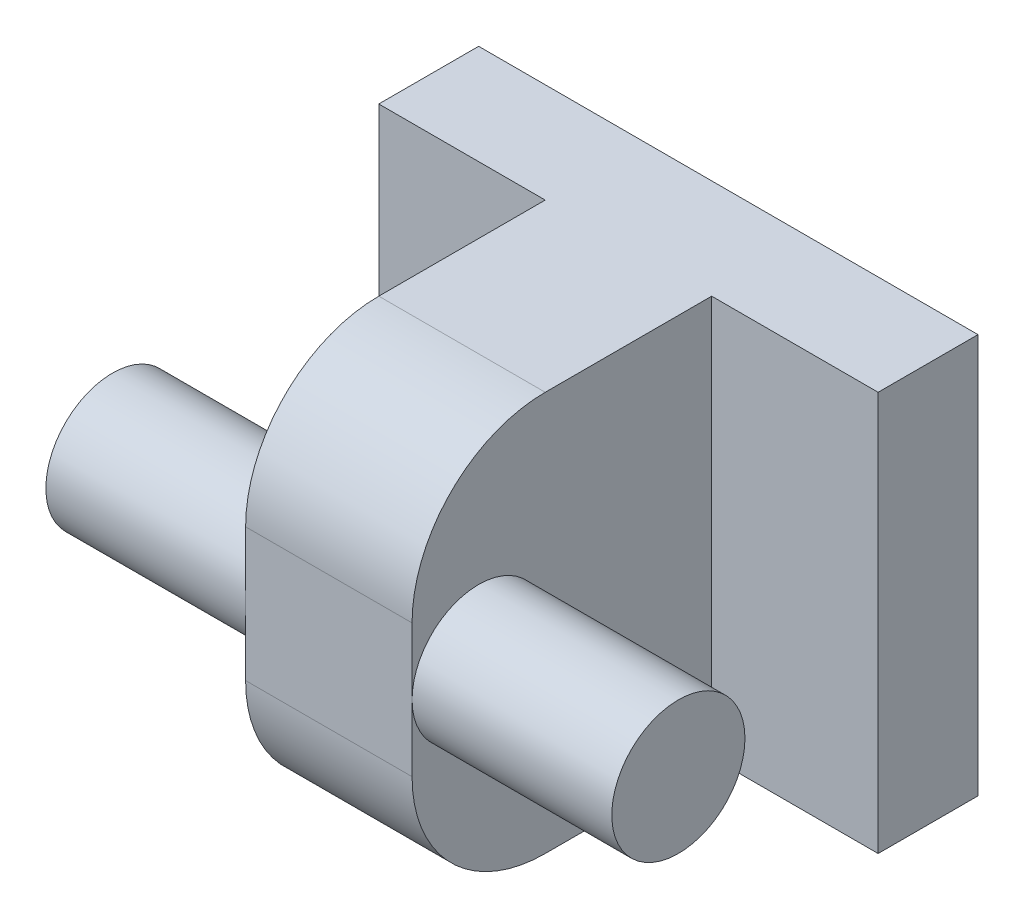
ISO-10303-21;
HEADER;
FILE_DESCRIPTION(('STEP AP214'),'2;1');
FILE_NAME('part.step','',(''),(''),'','','');
FILE_SCHEMA(('AUTOMOTIVE_DESIGN { 1 0 10303 214 1 1 1 1 }'));
ENDSEC;
DATA;
#1=APPLICATION_CONTEXT('core data for automotive mechanical design processes');
#2=APPLICATION_PROTOCOL_DEFINITION('international standard','automotive_design',2000,#1);
#3=PRODUCT_CONTEXT('',#1,'mechanical');
#4=PRODUCT('Part','Part','',(#3));
#5=PRODUCT_RELATED_PRODUCT_CATEGORY('part','',(#4));
#6=PRODUCT_DEFINITION_FORMATION('','',#4);
#7=PRODUCT_DEFINITION_CONTEXT('part definition',#1,'design');
#8=PRODUCT_DEFINITION('design','',#6,#7);
#9=PRODUCT_DEFINITION_SHAPE('','',#8);
#10=(LENGTH_UNIT() NAMED_UNIT(*) SI_UNIT(.MILLI.,.METRE.));
#11=(NAMED_UNIT(*) PLANE_ANGLE_UNIT() SI_UNIT($,.RADIAN.));
#12=(NAMED_UNIT(*) SI_UNIT($,.STERADIAN.) SOLID_ANGLE_UNIT());
#13=UNCERTAINTY_MEASURE_WITH_UNIT(LENGTH_MEASURE(1.E-05),#10,'distance_accuracy_value','');
#14=(GEOMETRIC_REPRESENTATION_CONTEXT(3) GLOBAL_UNCERTAINTY_ASSIGNED_CONTEXT((#13)) GLOBAL_UNIT_ASSIGNED_CONTEXT((#10,
#11,#12)) REPRESENTATION_CONTEXT('',''));
#15=CARTESIAN_POINT('',(0.,0.,0.));
#16=DIRECTION('',(0.,0.,1.));
#17=DIRECTION('',(1.,0.,0.));
#18=AXIS2_PLACEMENT_3D('',#15,#16,#17);
#19=CARTESIAN_POINT('',(0.,120.,30.));
#20=DIRECTION('',(0.,0.,-1.));
#21=DIRECTION('',(-1.,0.,0.));
#22=AXIS2_PLACEMENT_3D('',#19,#20,#21);
#23=PLANE('',#22);
#24=DIRECTION('',(0.,-1.,0.));
#25=VECTOR('',#24,1.);
#26=CARTESIAN_POINT('',(50.,0.,30.));
#27=LINE('',#26,#25);
#28=CARTESIAN_POINT('',(50.,120.,30.));
#29=VERTEX_POINT('',#28);
#30=CARTESIAN_POINT('',(50.,0.,30.));
#31=VERTEX_POINT('',#30);
#32=EDGE_CURVE('E137',#29,#31,#27,.T.);
#33=ORIENTED_EDGE('',*,*,#32,.F.);
#34=DIRECTION('',(-1.,0.,0.));
#35=VECTOR('',#34,1.);
#36=CARTESIAN_POINT('',(0.,120.,30.));
#37=LINE('',#36,#35);
#38=CARTESIAN_POINT('',(0.,120.,30.));
#39=VERTEX_POINT('',#38);
#40=EDGE_CURVE('E133',#29,#39,#37,.T.);
#41=ORIENTED_EDGE('',*,*,#40,.T.);
#42=DIRECTION('',(0.,-1.,0.));
#43=VECTOR('',#42,1.);
#44=CARTESIAN_POINT('',(0.,0.,30.));
#45=LINE('',#44,#43);
#46=CARTESIAN_POINT('',(0.,0.,30.));
#47=VERTEX_POINT('',#46);
#48=EDGE_CURVE('E156',#39,#47,#45,.T.);
#49=ORIENTED_EDGE('',*,*,#48,.T.);
#50=DIRECTION('',(1.,0.,0.));
#51=VECTOR('',#50,1.);
#52=CARTESIAN_POINT('',(0.,0.,30.));
#53=LINE('',#52,#51);
#54=EDGE_CURVE('E166',#47,#31,#53,.T.);
#55=ORIENTED_EDGE('',*,*,#54,.T.);
#56=EDGE_LOOP('',(#33,#41,#49,#55));
#57=FACE_BOUND('',#56,.T.);
#58=ADVANCED_FACE('F33',(#57),#23,.F.);
#59=DIRECTION('',(0.,1.,0.));
#60=VECTOR('',#59,1.);
#61=CARTESIAN_POINT('',(100.,0.,30.));
#62=LINE('',#61,#60);
#63=CARTESIAN_POINT('',(100.,0.,30.));
#64=VERTEX_POINT('',#63);
#65=CARTESIAN_POINT('',(100.,120.,30.));
#66=VERTEX_POINT('',#65);
#67=EDGE_CURVE('E127',#64,#66,#62,.T.);
#68=ORIENTED_EDGE('',*,*,#67,.F.);
#69=CARTESIAN_POINT('',(150.,0.,30.));
#70=VERTEX_POINT('',#69);
#71=EDGE_CURVE('E159',#64,#70,#53,.T.);
#72=ORIENTED_EDGE('',*,*,#71,.T.);
#73=DIRECTION('',(0.,1.,0.));
#74=VECTOR('',#73,1.);
#75=CARTESIAN_POINT('',(150.,0.,30.));
#76=LINE('',#75,#74);
#77=CARTESIAN_POINT('',(150.,120.,30.));
#78=VERTEX_POINT('',#77);
#79=EDGE_CURVE('E130',#70,#78,#76,.T.);
#80=ORIENTED_EDGE('',*,*,#79,.T.);
#81=EDGE_CURVE('E118',#78,#66,#37,.T.);
#82=ORIENTED_EDGE('',*,*,#81,.T.);
#83=EDGE_LOOP('',(#68,#72,#80,#82));
#84=FACE_BOUND('',#83,.T.);
#85=ADVANCED_FACE('F126',(#84),#23,.F.);
#86=CARTESIAN_POINT('',(0.,0.,30.));
#87=DIRECTION('',(1.,0.,0.));
#88=DIRECTION('',(0.,0.,-1.));
#89=AXIS2_PLACEMENT_3D('',#86,#87,#88);
#90=PLANE('',#89);
#91=DIRECTION('',(0.,-1.,0.));
#92=VECTOR('',#91,1.);
#93=CARTESIAN_POINT('',(0.,0.,0.));
#94=LINE('',#93,#92);
#95=CARTESIAN_POINT('',(0.,120.,0.));
#96=VERTEX_POINT('',#95);
#97=CARTESIAN_POINT('',(0.,0.,0.));
#98=VERTEX_POINT('',#97);
#99=EDGE_CURVE('E185',#96,#98,#94,.T.);
#100=ORIENTED_EDGE('',*,*,#99,.T.);
#101=DIRECTION('',(0.,0.,-1.));
#102=VECTOR('',#101,1.);
#103=CARTESIAN_POINT('',(0.,0.,30.));
#104=LINE('',#103,#102);
#105=EDGE_CURVE('E169',#47,#98,#104,.T.);
#106=ORIENTED_EDGE('',*,*,#105,.F.);
#107=ORIENTED_EDGE('',*,*,#48,.F.);
#108=DIRECTION('',(0.,0.,-1.));
#109=VECTOR('',#108,1.);
#110=CARTESIAN_POINT('',(0.,120.,30.));
#111=LINE('',#110,#109);
#112=EDGE_CURVE('E132',#39,#96,#111,.T.);
#113=ORIENTED_EDGE('',*,*,#112,.T.);
#114=EDGE_LOOP('',(#100,#106,#107,#113));
#115=FACE_BOUND('',#114,.T.);
#116=ADVANCED_FACE('F247',(#115),#90,.F.);
#117=CARTESIAN_POINT('',(0.,0.,30.));
#118=DIRECTION('',(0.,1.,0.));
#119=DIRECTION('',(0.,0.,1.));
#120=AXIS2_PLACEMENT_3D('',#117,#118,#119);
#121=PLANE('',#120);
#122=DIRECTION('',(0.,0.,-1.));
#123=VECTOR('',#122,1.);
#124=CARTESIAN_POINT('',(100.,0.,120.));
#125=LINE('',#124,#123);
#126=CARTESIAN_POINT('',(100.,0.,80.));
#127=VERTEX_POINT('',#126);
#128=EDGE_CURVE('E121',#127,#64,#125,.T.);
#129=ORIENTED_EDGE('',*,*,#128,.F.);
#130=DIRECTION('',(1.,0.,0.));
#131=VECTOR('',#130,1.);
#132=CARTESIAN_POINT('',(0.,0.,80.));
#133=LINE('',#132,#131);
#134=CARTESIAN_POINT('',(50.,0.,80.));
#135=VERTEX_POINT('',#134);
#136=EDGE_CURVE('E11',#127,#135,#133,.F.);
#137=ORIENTED_EDGE('',*,*,#136,.T.);
#138=DIRECTION('',(0.,0.,-1.));
#139=VECTOR('',#138,1.);
#140=CARTESIAN_POINT('',(50.,0.,120.));
#141=LINE('',#140,#139);
#142=EDGE_CURVE('E187',#135,#31,#141,.T.);
#143=ORIENTED_EDGE('',*,*,#142,.T.);
#144=ORIENTED_EDGE('',*,*,#54,.F.);
#145=ORIENTED_EDGE('',*,*,#105,.T.);
#146=DIRECTION('',(1.,0.,0.));
#147=VECTOR('',#146,1.);
#148=CARTESIAN_POINT('',(0.,0.,0.));
#149=LINE('',#148,#147);
#150=CARTESIAN_POINT('',(150.,0.,0.));
#151=VERTEX_POINT('',#150);
#152=EDGE_CURVE('E183',#98,#151,#149,.T.);
#153=ORIENTED_EDGE('',*,*,#152,.T.);
#154=DIRECTION('',(0.,0.,-1.));
#155=VECTOR('',#154,1.);
#156=CARTESIAN_POINT('',(150.,0.,30.));
#157=LINE('',#156,#155);
#158=EDGE_CURVE('E173',#70,#151,#157,.T.);
#159=ORIENTED_EDGE('',*,*,#158,.F.);
#160=ORIENTED_EDGE('',*,*,#71,.F.);
#161=EDGE_LOOP('',(#129,#137,#143,#144,#145,#153,#159,#160));
#162=FACE_BOUND('',#161,.T.);
#163=ADVANCED_FACE('F262',(#162),#121,.F.);
#164=CARTESIAN_POINT('',(150.,0.,30.));
#165=DIRECTION('',(-1.,0.,0.));
#166=DIRECTION('',(0.,0.,1.));
#167=AXIS2_PLACEMENT_3D('',#164,#165,#166);
#168=PLANE('',#167);
#169=DIRECTION('',(0.,1.,0.));
#170=VECTOR('',#169,1.);
#171=CARTESIAN_POINT('',(150.,0.,0.));
#172=LINE('',#171,#170);
#173=CARTESIAN_POINT('',(150.,120.,0.));
#174=VERTEX_POINT('',#173);
#175=EDGE_CURVE('E181',#151,#174,#172,.T.);
#176=ORIENTED_EDGE('',*,*,#175,.T.);
#177=DIRECTION('',(0.,0.,-1.));
#178=VECTOR('',#177,1.);
#179=CARTESIAN_POINT('',(150.,120.,30.));
#180=LINE('',#179,#178);
#181=EDGE_CURVE('E176',#78,#174,#180,.T.);
#182=ORIENTED_EDGE('',*,*,#181,.F.);
#183=ORIENTED_EDGE('',*,*,#79,.F.);
#184=ORIENTED_EDGE('',*,*,#158,.T.);
#185=EDGE_LOOP('',(#176,#182,#183,#184));
#186=FACE_BOUND('',#185,.T.);
#187=ADVANCED_FACE('F259',(#186),#168,.F.);
#188=CARTESIAN_POINT('',(0.,120.,30.));
#189=DIRECTION('',(0.,-1.,0.));
#190=DIRECTION('',(0.,0.,-1.));
#191=AXIS2_PLACEMENT_3D('',#188,#189,#190);
#192=PLANE('',#191);
#193=DIRECTION('',(0.,0.,-1.));
#194=VECTOR('',#193,1.);
#195=CARTESIAN_POINT('',(50.,120.,120.));
#196=LINE('',#195,#194);
#197=CARTESIAN_POINT('',(50.,120.,80.));
#198=VERTEX_POINT('',#197);
#199=EDGE_CURVE('E122',#198,#29,#196,.T.);
#200=ORIENTED_EDGE('',*,*,#199,.F.);
#201=DIRECTION('',(-1.,0.,0.));
#202=VECTOR('',#201,1.);
#203=CARTESIAN_POINT('',(0.,120.,80.));
#204=LINE('',#203,#202);
#205=CARTESIAN_POINT('',(100.,120.,80.));
#206=VERTEX_POINT('',#205);
#207=EDGE_CURVE('E56',#198,#206,#204,.F.);
#208=ORIENTED_EDGE('',*,*,#207,.T.);
#209=DIRECTION('',(0.,0.,-1.));
#210=VECTOR('',#209,1.);
#211=CARTESIAN_POINT('',(100.,120.,120.));
#212=LINE('',#211,#210);
#213=EDGE_CURVE('E114',#206,#66,#212,.T.);
#214=ORIENTED_EDGE('',*,*,#213,.T.);
#215=ORIENTED_EDGE('',*,*,#81,.F.);
#216=ORIENTED_EDGE('',*,*,#181,.T.);
#217=DIRECTION('',(-1.,0.,0.));
#218=VECTOR('',#217,1.);
#219=CARTESIAN_POINT('',(0.,120.,0.));
#220=LINE('',#219,#218);
#221=EDGE_CURVE('E160',#174,#96,#220,.T.);
#222=ORIENTED_EDGE('',*,*,#221,.T.);
#223=ORIENTED_EDGE('',*,*,#112,.F.);
#224=ORIENTED_EDGE('',*,*,#40,.F.);
#225=EDGE_LOOP('',(#200,#208,#214,#215,#216,#222,#223,#224));
#226=FACE_BOUND('',#225,.T.);
#227=ADVANCED_FACE('F116',(#226),#192,.F.);
#228=CARTESIAN_POINT('',(0.,120.,0.));
#229=DIRECTION('',(0.,0.,-1.));
#230=DIRECTION('',(-1.,0.,0.));
#231=AXIS2_PLACEMENT_3D('',#228,#229,#230);
#232=PLANE('',#231);
#233=CARTESIAN_POINT('',(75.,60.,0.));
#234=DIRECTION('',(0.,0.,-1.));
#235=DIRECTION('',(-1.,0.,0.));
#236=AXIS2_PLACEMENT_3D('',#233,#234,#235);
#237=CIRCLE('',#236,20.);
#238=CARTESIAN_POINT('',(55.,60.,0.));
#239=VERTEX_POINT('',#238);
#240=EDGE_CURVE('E367',#239,#239,#237,.T.);
#241=ORIENTED_EDGE('',*,*,#240,.F.);
#242=EDGE_LOOP('',(#241));
#243=FACE_BOUND('',#242,.T.);
#244=ORIENTED_EDGE('',*,*,#99,.F.);
#245=ORIENTED_EDGE('',*,*,#221,.F.);
#246=ORIENTED_EDGE('',*,*,#175,.F.);
#247=ORIENTED_EDGE('',*,*,#152,.F.);
#248=EDGE_LOOP('',(#244,#245,#246,#247));
#249=FACE_BOUND('',#248,.T.);
#250=ADVANCED_FACE('F253',(#243,#249),#232,.T.);
#251=CARTESIAN_POINT('',(50.,0.,120.));
#252=DIRECTION('',(1.,0.,0.));
#253=DIRECTION('',(0.,0.,-1.));
#254=AXIS2_PLACEMENT_3D('',#251,#252,#253);
#255=PLANE('',#254);
#256=DIRECTION('',(0.,-1.,0.));
#257=VECTOR('',#256,1.);
#258=CARTESIAN_POINT('',(50.,0.,120.));
#259=LINE('',#258,#257);
#260=CARTESIAN_POINT('',(50.,80.,120.));
#261=VERTEX_POINT('',#260);
#262=CARTESIAN_POINT('',(50.,60.,120.));
#263=VERTEX_POINT('',#262);
#264=EDGE_CURVE('E140',#261,#263,#259,.T.);
#265=ORIENTED_EDGE('',*,*,#264,.F.);
#266=CARTESIAN_POINT('',(50.,80.,80.));
#267=DIRECTION('',(1.,0.,0.));
#268=DIRECTION('',(0.,0.,-1.));
#269=AXIS2_PLACEMENT_3D('',#266,#267,#268);
#270=CIRCLE('',#269,40.);
#271=EDGE_CURVE('E215',#261,#198,#270,.F.);
#272=ORIENTED_EDGE('',*,*,#271,.T.);
#273=ORIENTED_EDGE('',*,*,#199,.T.);
#274=ORIENTED_EDGE('',*,*,#32,.T.);
#275=ORIENTED_EDGE('',*,*,#142,.F.);
#276=CARTESIAN_POINT('',(50.,40.,80.));
#277=DIRECTION('',(1.,0.,0.));
#278=DIRECTION('',(0.,0.,-1.));
#279=AXIS2_PLACEMENT_3D('',#276,#277,#278);
#280=CIRCLE('',#279,40.);
#281=CARTESIAN_POINT('',(50.,40.,120.));
#282=VERTEX_POINT('',#281);
#283=EDGE_CURVE('E202',#135,#282,#280,.F.);
#284=ORIENTED_EDGE('',*,*,#283,.T.);
#285=EDGE_CURVE('E136',#263,#282,#259,.T.);
#286=ORIENTED_EDGE('',*,*,#285,.F.);
#287=CARTESIAN_POINT('',(50.,60.,100.));
#288=DIRECTION('',(1.,0.,0.));
#289=DIRECTION('',(0.,0.,-1.));
#290=AXIS2_PLACEMENT_3D('',#287,#288,#289);
#291=CIRCLE('',#290,20.);
#292=EDGE_CURVE('E143',#263,#263,#291,.T.);
#293=ORIENTED_EDGE('',*,*,#292,.T.);
#294=EDGE_LOOP('',(#265,#272,#273,#274,#275,#284,#286,#293));
#295=FACE_BOUND('',#294,.T.);
#296=ADVANCED_FACE('F251',(#295),#255,.F.);
#297=CARTESIAN_POINT('',(100.,0.,120.));
#298=DIRECTION('',(-1.,0.,0.));
#299=DIRECTION('',(0.,0.,1.));
#300=AXIS2_PLACEMENT_3D('',#297,#298,#299);
#301=PLANE('',#300);
#302=ORIENTED_EDGE('',*,*,#213,.F.);
#303=CARTESIAN_POINT('',(100.,80.,80.));
#304=DIRECTION('',(-1.,0.,0.));
#305=DIRECTION('',(0.,0.,1.));
#306=AXIS2_PLACEMENT_3D('',#303,#304,#305);
#307=CIRCLE('',#306,40.);
#308=CARTESIAN_POINT('',(100.,80.,120.));
#309=VERTEX_POINT('',#308);
#310=EDGE_CURVE('E41',#206,#309,#307,.F.);
#311=ORIENTED_EDGE('',*,*,#310,.T.);
#312=DIRECTION('',(0.,1.,0.));
#313=VECTOR('',#312,1.);
#314=CARTESIAN_POINT('',(100.,0.,120.));
#315=LINE('',#314,#313);
#316=CARTESIAN_POINT('',(100.,60.,120.));
#317=VERTEX_POINT('',#316);
#318=EDGE_CURVE('E223',#317,#309,#315,.T.);
#319=ORIENTED_EDGE('',*,*,#318,.F.);
#320=CARTESIAN_POINT('',(100.,60.,100.));
#321=DIRECTION('',(-1.,0.,0.));
#322=DIRECTION('',(0.,0.,1.));
#323=AXIS2_PLACEMENT_3D('',#320,#321,#322);
#324=CIRCLE('',#323,20.);
#325=EDGE_CURVE('E377',#317,#317,#324,.T.);
#326=ORIENTED_EDGE('',*,*,#325,.T.);
#327=CARTESIAN_POINT('',(100.,40.,120.));
#328=VERTEX_POINT('',#327);
#329=EDGE_CURVE('E226',#328,#317,#315,.T.);
#330=ORIENTED_EDGE('',*,*,#329,.F.);
#331=CARTESIAN_POINT('',(100.,40.,80.));
#332=DIRECTION('',(-1.,0.,0.));
#333=DIRECTION('',(0.,0.,1.));
#334=AXIS2_PLACEMENT_3D('',#331,#332,#333);
#335=CIRCLE('',#334,40.);
#336=EDGE_CURVE('E48',#328,#127,#335,.F.);
#337=ORIENTED_EDGE('',*,*,#336,.T.);
#338=ORIENTED_EDGE('',*,*,#128,.T.);
#339=ORIENTED_EDGE('',*,*,#67,.T.);
#340=EDGE_LOOP('',(#302,#311,#319,#326,#330,#337,#338,#339));
#341=FACE_BOUND('',#340,.T.);
#342=ADVANCED_FACE('F135',(#341),#301,.F.);
#343=CARTESIAN_POINT('',(50.,120.,120.));
#344=DIRECTION('',(0.,0.,-1.));
#345=DIRECTION('',(-1.,0.,0.));
#346=AXIS2_PLACEMENT_3D('',#343,#344,#345);
#347=PLANE('',#346);
#348=ORIENTED_EDGE('',*,*,#318,.T.);
#349=DIRECTION('',(-1.,0.,0.));
#350=VECTOR('',#349,1.);
#351=CARTESIAN_POINT('',(50.,80.,120.));
#352=LINE('',#351,#350);
#353=EDGE_CURVE('E209',#309,#261,#352,.T.);
#354=ORIENTED_EDGE('',*,*,#353,.T.);
#355=ORIENTED_EDGE('',*,*,#264,.T.);
#356=ORIENTED_EDGE('',*,*,#285,.T.);
#357=DIRECTION('',(1.,0.,0.));
#358=VECTOR('',#357,1.);
#359=CARTESIAN_POINT('',(50.,40.,120.));
#360=LINE('',#359,#358);
#361=EDGE_CURVE('E172',#282,#328,#360,.T.);
#362=ORIENTED_EDGE('',*,*,#361,.T.);
#363=ORIENTED_EDGE('',*,*,#329,.T.);
#364=EDGE_LOOP('',(#348,#354,#355,#356,#362,#363));
#365=FACE_BOUND('',#364,.T.);
#366=ADVANCED_FACE('F225',(#365),#347,.F.);
#367=CARTESIAN_POINT('',(160.,60.,100.));
#368=DIRECTION('',(1.,0.,0.));
#369=DIRECTION('',(0.,0.,-1.));
#370=AXIS2_PLACEMENT_3D('',#367,#368,#369);
#371=PLANE('',#370);
#372=CARTESIAN_POINT('',(160.,60.,100.));
#373=DIRECTION('',(1.,0.,0.));
#374=DIRECTION('',(0.,0.,-1.));
#375=AXIS2_PLACEMENT_3D('',#372,#373,#374);
#376=CIRCLE('',#375,20.);
#377=CARTESIAN_POINT('',(160.,60.,80.));
#378=VERTEX_POINT('',#377);
#379=EDGE_CURVE('E366',#378,#378,#376,.T.);
#380=ORIENTED_EDGE('',*,*,#379,.T.);
#381=EDGE_LOOP('',(#380));
#382=FACE_BOUND('',#381,.T.);
#383=ADVANCED_FACE('F305',(#382),#371,.T.);
#384=CARTESIAN_POINT('',(-10.,60.,100.));
#385=DIRECTION('',(1.,0.,0.));
#386=DIRECTION('',(0.,0.,-1.));
#387=AXIS2_PLACEMENT_3D('',#384,#385,#386);
#388=CYLINDRICAL_SURFACE('',#387,20.);
#389=ORIENTED_EDGE('',*,*,#379,.F.);
#390=EDGE_LOOP('',(#389));
#391=FACE_BOUND('',#390,.T.);
#392=ORIENTED_EDGE('',*,*,#325,.F.);
#393=EDGE_LOOP('',(#392));
#394=FACE_BOUND('',#393,.T.);
#395=ADVANCED_FACE('F312',(#391,#394),#388,.T.);
#396=CARTESIAN_POINT('',(-10.,60.,100.));
#397=DIRECTION('',(1.,0.,0.));
#398=DIRECTION('',(0.,0.,-1.));
#399=AXIS2_PLACEMENT_3D('',#396,#397,#398);
#400=CIRCLE('',#399,20.);
#401=CARTESIAN_POINT('',(-10.,60.,80.));
#402=VERTEX_POINT('',#401);
#403=EDGE_CURVE('E370',#402,#402,#400,.T.);
#404=ORIENTED_EDGE('',*,*,#403,.T.);
#405=EDGE_LOOP('',(#404));
#406=FACE_BOUND('',#405,.T.);
#407=ORIENTED_EDGE('',*,*,#292,.F.);
#408=EDGE_LOOP('',(#407));
#409=FACE_BOUND('',#408,.T.);
#410=ADVANCED_FACE('F237',(#406,#409),#388,.T.);
#411=CARTESIAN_POINT('',(-10.,60.,100.));
#412=DIRECTION('',(1.,0.,0.));
#413=DIRECTION('',(0.,0.,-1.));
#414=AXIS2_PLACEMENT_3D('',#411,#412,#413);
#415=PLANE('',#414);
#416=ORIENTED_EDGE('',*,*,#403,.F.);
#417=EDGE_LOOP('',(#416));
#418=FACE_BOUND('',#417,.T.);
#419=ADVANCED_FACE('F230',(#418),#415,.F.);
#420=CARTESIAN_POINT('',(50.,80.,80.));
#421=DIRECTION('',(-1.,0.,0.));
#422=DIRECTION('',(0.,0.,1.));
#423=AXIS2_PLACEMENT_3D('',#420,#421,#422);
#424=CYLINDRICAL_SURFACE('',#423,40.);
#425=ORIENTED_EDGE('',*,*,#310,.F.);
#426=ORIENTED_EDGE('',*,*,#207,.F.);
#427=ORIENTED_EDGE('',*,*,#271,.F.);
#428=ORIENTED_EDGE('',*,*,#353,.F.);
#429=EDGE_LOOP('',(#425,#426,#427,#428));
#430=FACE_BOUND('',#429,.T.);
#431=ADVANCED_FACE('F228',(#430),#424,.T.);
#432=CARTESIAN_POINT('',(50.,40.,80.));
#433=DIRECTION('',(1.,0.,0.));
#434=DIRECTION('',(0.,0.,-1.));
#435=AXIS2_PLACEMENT_3D('',#432,#433,#434);
#436=CYLINDRICAL_SURFACE('',#435,40.);
#437=ORIENTED_EDGE('',*,*,#283,.F.);
#438=ORIENTED_EDGE('',*,*,#136,.F.);
#439=ORIENTED_EDGE('',*,*,#336,.F.);
#440=ORIENTED_EDGE('',*,*,#361,.F.);
#441=EDGE_LOOP('',(#437,#438,#439,#440));
#442=FACE_BOUND('',#441,.T.);
#443=ADVANCED_FACE('F35',(#442),#436,.T.);
#444=CARTESIAN_POINT('',(75.,60.,40.));
#445=DIRECTION('',(0.,0.,-1.));
#446=DIRECTION('',(-1.,0.,0.));
#447=AXIS2_PLACEMENT_3D('',#444,#445,#446);
#448=CYLINDRICAL_SURFACE('',#447,20.);
#449=CARTESIAN_POINT('',(75.,60.,40.));
#450=DIRECTION('',(0.,0.,-1.));
#451=DIRECTION('',(-1.,0.,0.));
#452=AXIS2_PLACEMENT_3D('',#449,#450,#451);
#453=CIRCLE('',#452,20.);
#454=CARTESIAN_POINT('',(55.,60.,40.));
#455=VERTEX_POINT('',#454);
#456=EDGE_CURVE('E365',#455,#455,#453,.T.);
#457=ORIENTED_EDGE('',*,*,#456,.F.);
#458=EDGE_LOOP('',(#457));
#459=FACE_BOUND('',#458,.T.);
#460=ORIENTED_EDGE('',*,*,#240,.T.);
#461=EDGE_LOOP('',(#460));
#462=FACE_BOUND('',#461,.T.);
#463=ADVANCED_FACE('F235',(#459,#462),#448,.F.);
#464=CARTESIAN_POINT('',(75.,60.,40.));
#465=DIRECTION('',(0.,0.,-1.));
#466=DIRECTION('',(-1.,0.,0.));
#467=AXIS2_PLACEMENT_3D('',#464,#465,#466);
#468=PLANE('',#467);
#469=ORIENTED_EDGE('',*,*,#456,.T.);
#470=EDGE_LOOP('',(#469));
#471=FACE_BOUND('',#470,.T.);
#472=ADVANCED_FACE('F349',(#471),#468,.T.);
#473=CLOSED_SHELL('',(#58,#85,#116,#163,#187,#227,#250,#296,#342,#366,#383,#395,#410,#419,#431,
#443,#463,#472));
#474=MANIFOLD_SOLID_BREP('B2',#473);
#475=ADVANCED_BREP_SHAPE_REPRESENTATION('',(#18,#474),#14);
#476=SHAPE_DEFINITION_REPRESENTATION(#9,#475);
ENDSEC;
END-ISO-10303-21;
